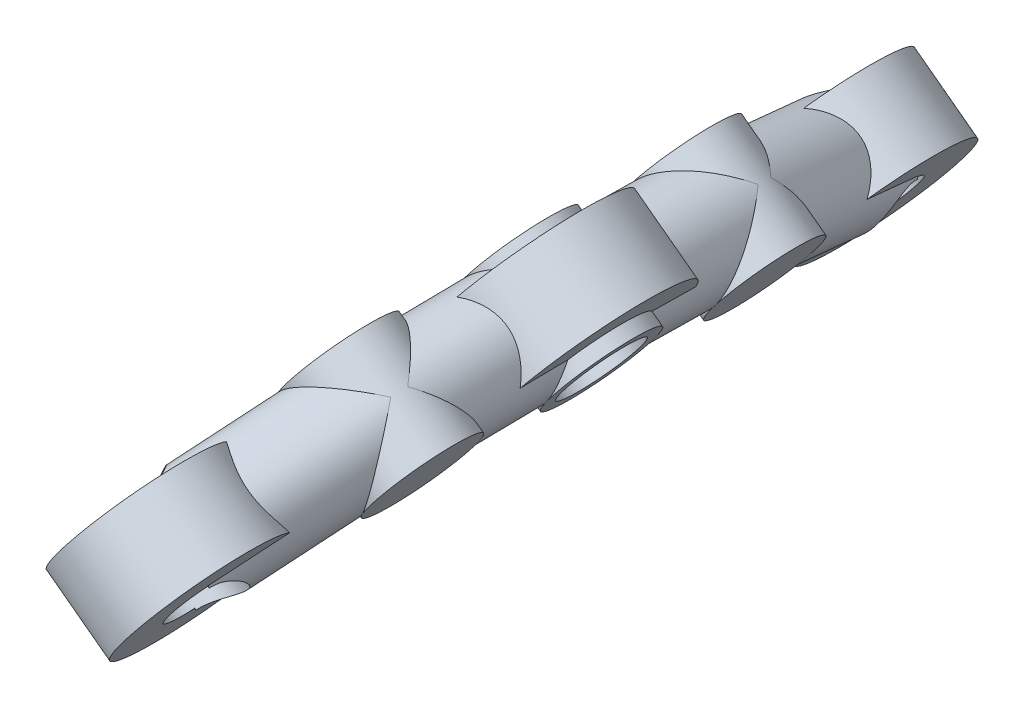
from build123d import *

# Parameters (mm, degrees)
ARCO_1_PROFILE_R           = 4
ARCO_2_PROFILE_R           = 4
ARCO_3_PROFILE_R           = 4
ARCO_4_PROFILE_R           = 4
ARCO_CODO_1_PROFILE_R      = 4
ARCO_CODO_2_PROFILE_R      = 4
ARCO_CODO_3_PROFILE_R      = 4
BOSS_IZQ_PROFILE_R         = 6
BOSS_DCHO_PROFILE_R        = 6
BOSS_CENTRO_PROFILE_R      = 7
PIVOTE_IZQ_PROFILE_R       = 2.5
PIVOTE_DCHO_PROFILE_R      = 2.5
TALADRO_TORNILLO_PROFILE_R = 3


with BuildPart() as part:
    # Arco_1: sweep along a curve in space
    with BuildLine() as arco_1_path:
        Line((-231.363734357, 348.939584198, -26), (-228.368101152, 352.942855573, -13))
    # Arco_1 profile (on start of the path) → Arco_1 (sweep)
    with BuildSketch(Plane(origin=(-231.363734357, 348.939584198, -26), x_dir=(0, 0.9557113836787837, -0.29430554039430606), z_dir=(0.215073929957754, 0.28741813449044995, 0.9333456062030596))):
        Circle(ARCO_1_PROFILE_R)
    sweep(path=arco_1_path.line)

    # Arco_2: sweep along a curve in space
    with BuildLine() as arco_2_path:
        Line((-228.368101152, 352.942855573, -13), (-227.768974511, 353.743509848, 0))
    # Arco_2 profile (on start of the path) → Arco_2 (sweep)
    with BuildSketch(Plane(origin=(-228.368101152, 352.942855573, -13), x_dir=(0, 0.9981087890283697, -0.06147231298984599), z_dir=(0.04595091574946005, 0.06140737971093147, 0.9970544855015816))):
        Circle(ARCO_2_PROFILE_R)
    sweep(path=arco_2_path.line)

    # Arco_3: sweep along a curve in space
    with BuildLine() as arco_3_path:
        Line((-227.768974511, 353.743509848, 0), (-228.368101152, 352.942855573, 13))
    # Arco_3 profile (on start of the path) → Arco_3 (sweep)
    with BuildSketch(Plane(origin=(-227.768974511, 353.743509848, 0), x_dir=(0, 0.9981087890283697, 0.06147231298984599), z_dir=(-0.04595091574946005, -0.06140737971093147, 0.9970544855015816))):
        Circle(ARCO_3_PROFILE_R)
    sweep(path=arco_3_path.line)

    # Arco_4: sweep along a curve in space
    with BuildLine() as arco_4_path:
        Line((-228.368101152, 352.942855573, 13), (-231.363734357, 348.939584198, 26))
    # Arco_4 profile (on start of the path) → Arco_4 (sweep)
    with BuildSketch(Plane(origin=(-228.368101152, 352.942855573, 13), x_dir=(0, 0.9557113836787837, 0.29430554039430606), z_dir=(-0.215073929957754, -0.28741813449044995, 0.9333456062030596))):
        Circle(ARCO_4_PROFILE_R)
    sweep(path=arco_4_path.line)

    # Arco_codo_1: sweep along a curve in space
    with BuildLine() as arco_codo_1_path:
        Line((-225.165484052, 350.546349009, -13), (-231.570718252, 355.339362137, -13))
    # Arco_codo_1 profile (on start of the path) → Arco_codo_1 (sweep)
    with BuildSketch(Plane(origin=(-225.165484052, 350.546349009, -13), x_dir=(-0.5991266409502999, -0.8006542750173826, 0), z_dir=(-0.8006542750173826, 0.5991266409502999, 0))):
        Circle(ARCO_CODO_1_PROFILE_R)
    sweep(path=arco_codo_1_path.line)

    # Arco_codo_2: sweep along a curve in space
    with BuildLine() as arco_codo_2_path:
        Line((-224.566357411, 351.347003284, 0), (-230.971591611, 356.140016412, 0))
    # Arco_codo_2 profile (on start of the path) → Arco_codo_2 (sweep)
    with BuildSketch(Plane(origin=(-224.566357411, 351.347003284, 0), x_dir=(-0.5991266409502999, -0.8006542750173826, 0), z_dir=(-0.8006542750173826, 0.5991266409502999, 0))):
        Circle(ARCO_CODO_2_PROFILE_R)
    sweep(path=arco_codo_2_path.line)

    # Arco_codo_3: sweep along a curve in space
    with BuildLine() as arco_codo_3_path:
        Line((-225.165484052, 350.546349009, 13), (-231.570718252, 355.339362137, 13))
    # Arco_codo_3 profile (on start of the path) → Arco_codo_3 (sweep)
    with BuildSketch(Plane(origin=(-225.165484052, 350.546349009, 13), x_dir=(-0.5991266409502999, -0.8006542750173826, 0), z_dir=(-0.8006542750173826, 0.5991266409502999, 0))):
        Circle(ARCO_CODO_3_PROFILE_R)
    sweep(path=arco_codo_3_path.line)

    # Boss_izq: sweep along a curve in space
    with BuildLine() as boss_izq_path:
        Line((-228.961771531, 347.142204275, -26), (-233.765697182, 350.736964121, -26))
    # Boss_izq profile (on start of the path) → Boss_izq (sweep)
    with BuildSketch(Plane(origin=(-228.961771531, 347.142204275, -26), x_dir=(-0.5991266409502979, -0.8006542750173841, 0), z_dir=(-0.8006542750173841, 0.5991266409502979, 0))):
        Circle(BOSS_IZQ_PROFILE_R)
    sweep(path=boss_izq_path.line)

    # Boss_dcho: sweep along a curve in space
    with BuildLine() as boss_dcho_path:
        Line((-228.961771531, 347.142204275, 26), (-233.765697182, 350.736964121, 26))
    # Boss_dcho profile (on start of the path) → Boss_dcho (sweep)
    with BuildSketch(Plane(origin=(-228.961771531, 347.142204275, 26), x_dir=(-0.5991266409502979, -0.8006542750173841, 0), z_dir=(-0.8006542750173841, 0.5991266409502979, 0))):
        Circle(BOSS_DCHO_PROFILE_R)
    sweep(path=boss_dcho_path.line)

    # Boss_centro: sweep along a curve in space
    with BuildLine() as boss_centro_path:
        Line((-225.367011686, 351.946129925, 0), (-230.170937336, 355.540889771, 0))
    # Boss_centro profile (on start of the path) → Boss_centro (sweep)
    with BuildSketch(Plane(origin=(-225.367011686, 351.946129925, 0), x_dir=(-0.5991266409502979, -0.8006542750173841, 0), z_dir=(-0.8006542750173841, 0.5991266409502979, 0))):
        Circle(BOSS_CENTRO_PROFILE_R)
    sweep(path=boss_centro_path.line)

    # Pivote_izq: sweep along a curve in space
    with BuildLine() as pivote_izq_path:
        Line((-228.161117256, 346.543077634, -26), (-234.566351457, 351.336090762, -26))
    # Pivote_izq profile (on start of the path) → Pivote_izq (sweep, cut)
    with BuildSketch(Plane(origin=(-228.161117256, 346.543077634, -26), x_dir=(-0.5991266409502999, -0.8006542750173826, 0), z_dir=(-0.8006542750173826, 0.5991266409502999, 0))):
        Circle(PIVOTE_IZQ_PROFILE_R)
    sweep(path=pivote_izq_path.line, mode=Mode.SUBTRACT)

    # Pivote_dcho: sweep along a curve in space
    with BuildLine() as pivote_dcho_path:
        Line((-228.161117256, 346.543077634, 26), (-234.566351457, 351.336090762, 26))
    # Pivote_dcho profile (on start of the path) → Pivote_dcho (sweep, cut)
    with BuildSketch(Plane(origin=(-228.161117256, 346.543077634, 26), x_dir=(-0.5991266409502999, -0.8006542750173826, 0), z_dir=(-0.8006542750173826, 0.5991266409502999, 0))):
        Circle(PIVOTE_DCHO_PROFILE_R)
    sweep(path=pivote_dcho_path.line, mode=Mode.SUBTRACT)

    # Taladro_tornillo: sweep along a curve in space
    with BuildLine() as taladro_tornillo_path:
        Line((-224.566357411, 351.347003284, 0), (-230.971591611, 356.140016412, 0))
    # Taladro_tornillo profile (on start of the path) → Taladro_tornillo (sweep, cut)
    with BuildSketch(Plane(origin=(-224.566357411, 351.347003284, 0), x_dir=(-0.5991266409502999, -0.8006542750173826, 0), z_dir=(-0.8006542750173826, 0.5991266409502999, 0))):
        Circle(TALADRO_TORNILLO_PROFILE_R)
    sweep(path=taladro_tornillo_path.line, mode=Mode.SUBTRACT)


solid = part.part
